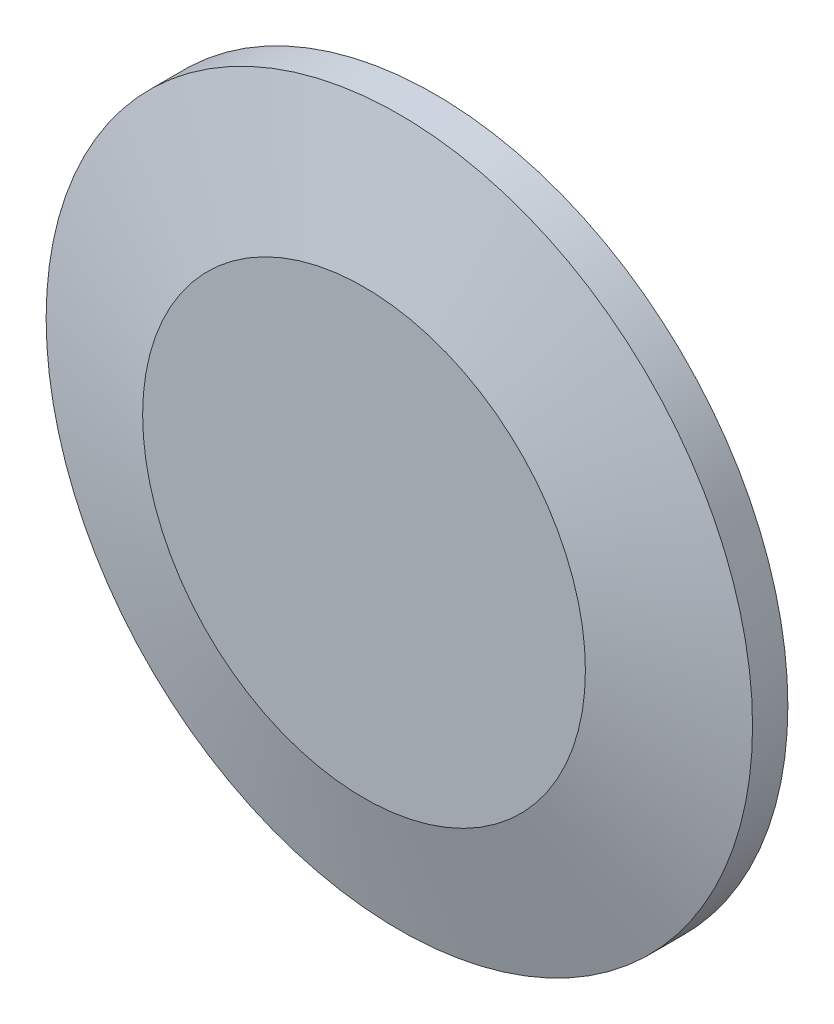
from build123d import *

# Parameters (mm, degrees)
SKETCH1_R           = 25.4
BOSS_EXTRUDE1_DEPTH = 2.54
SKETCH2_R           = 25.4
BOSS_EXTRUDE2_DEPTH = 2.54
BOSS_EXTRUDE2_TAPER = 75
SKETCH4_R           = 2.54
CUT_EXTRUDE2_DEPTH  = 2.54


with BuildPart() as part:
    # Sketch1 → Boss-Extrude1 (new body)
    with BuildSketch(Plane.XY):
        Circle(SKETCH1_R)
    extrude(amount=BOSS_EXTRUDE1_DEPTH)

    # Sketch2 → Boss-Extrude2 (add)
    with BuildSketch(Plane.XY.offset(2.54)):
        Circle(SKETCH2_R)
    extrude(amount=BOSS_EXTRUDE2_DEPTH, taper=BOSS_EXTRUDE2_TAPER)

    # Sketch4 → Cut-Extrude2 (cut)
    with BuildSketch(Plane(origin=(0, 0, 0), x_dir=(-1, 0, 0), z_dir=(0, 0, -1))):
        Circle(SKETCH4_R)
    extrude(amount=-CUT_EXTRUDE2_DEPTH, mode=Mode.SUBTRACT)


solid = part.part
